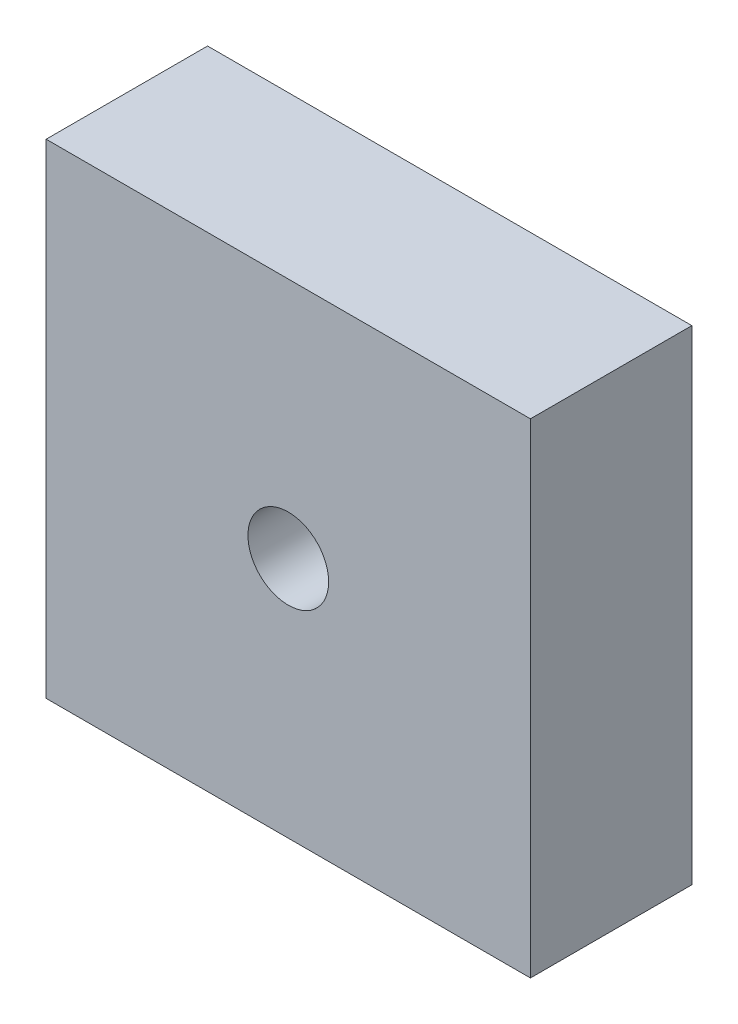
ISO-10303-21;
HEADER;
FILE_DESCRIPTION(('STEP AP214'),'2;1');
FILE_NAME('part.step','',(''),(''),'','','');
FILE_SCHEMA(('AUTOMOTIVE_DESIGN { 1 0 10303 214 1 1 1 1 }'));
ENDSEC;
DATA;
#1=APPLICATION_CONTEXT('core data for automotive mechanical design processes');
#2=APPLICATION_PROTOCOL_DEFINITION('international standard','automotive_design',2000,#1);
#3=PRODUCT_CONTEXT('',#1,'mechanical');
#4=PRODUCT('Part','Part','',(#3));
#5=PRODUCT_RELATED_PRODUCT_CATEGORY('part','',(#4));
#6=PRODUCT_DEFINITION_FORMATION('','',#4);
#7=PRODUCT_DEFINITION_CONTEXT('part definition',#1,'design');
#8=PRODUCT_DEFINITION('design','',#6,#7);
#9=PRODUCT_DEFINITION_SHAPE('','',#8);
#10=(LENGTH_UNIT() NAMED_UNIT(*) SI_UNIT(.MILLI.,.METRE.));
#11=(NAMED_UNIT(*) PLANE_ANGLE_UNIT() SI_UNIT($,.RADIAN.));
#12=(NAMED_UNIT(*) SI_UNIT($,.STERADIAN.) SOLID_ANGLE_UNIT());
#13=UNCERTAINTY_MEASURE_WITH_UNIT(LENGTH_MEASURE(1.E-05),#10,'distance_accuracy_value','');
#14=(GEOMETRIC_REPRESENTATION_CONTEXT(3) GLOBAL_UNCERTAINTY_ASSIGNED_CONTEXT((#13)) GLOBAL_UNIT_ASSIGNED_CONTEXT((#10,
#11,#12)) REPRESENTATION_CONTEXT('',''));
#15=CARTESIAN_POINT('',(0.,0.,0.));
#16=DIRECTION('',(0.,0.,1.));
#17=DIRECTION('',(1.,0.,0.));
#18=AXIS2_PLACEMENT_3D('',#15,#16,#17);
#19=CARTESIAN_POINT('',(0.,0.,5.));
#20=DIRECTION('',(0.,0.,-1.));
#21=DIRECTION('',(-1.,0.,0.));
#22=AXIS2_PLACEMENT_3D('',#19,#20,#21);
#23=PLANE('',#22);
#24=DIRECTION('',(0.,1.,0.));
#25=VECTOR('',#24,1.);
#26=CARTESIAN_POINT('',(15.,-15.,5.));
#27=LINE('',#26,#25);
#28=CARTESIAN_POINT('',(15.,-15.,5.));
#29=VERTEX_POINT('',#28);
#30=CARTESIAN_POINT('',(15.,15.,5.));
#31=VERTEX_POINT('',#30);
#32=EDGE_CURVE('E91',#29,#31,#27,.T.);
#33=ORIENTED_EDGE('',*,*,#32,.T.);
#34=DIRECTION('',(-1.,0.,0.));
#35=VECTOR('',#34,1.);
#36=CARTESIAN_POINT('',(-15.,15.,5.));
#37=LINE('',#36,#35);
#38=CARTESIAN_POINT('',(-15.,15.,5.));
#39=VERTEX_POINT('',#38);
#40=EDGE_CURVE('E86',#31,#39,#37,.T.);
#41=ORIENTED_EDGE('',*,*,#40,.T.);
#42=DIRECTION('',(0.,-1.,0.));
#43=VECTOR('',#42,1.);
#44=CARTESIAN_POINT('',(-15.,-15.,5.));
#45=LINE('',#44,#43);
#46=CARTESIAN_POINT('',(-15.,-15.,5.));
#47=VERTEX_POINT('',#46);
#48=EDGE_CURVE('E89',#39,#47,#45,.T.);
#49=ORIENTED_EDGE('',*,*,#48,.T.);
#50=DIRECTION('',(1.,0.,0.));
#51=VECTOR('',#50,1.);
#52=CARTESIAN_POINT('',(-15.,-15.,5.));
#53=LINE('',#52,#51);
#54=EDGE_CURVE('E56',#47,#29,#53,.T.);
#55=ORIENTED_EDGE('',*,*,#54,.T.);
#56=EDGE_LOOP('',(#33,#41,#49,#55));
#57=FACE_BOUND('',#56,.T.);
#58=CARTESIAN_POINT('',(0.,0.,5.));
#59=DIRECTION('',(0.,0.,1.));
#60=DIRECTION('',(1.,0.,0.));
#61=AXIS2_PLACEMENT_3D('',#58,#59,#60);
#62=CIRCLE('',#61,2.5);
#63=CARTESIAN_POINT('',(2.5,0.,5.));
#64=VERTEX_POINT('',#63);
#65=EDGE_CURVE('E106',#64,#64,#62,.T.);
#66=ORIENTED_EDGE('',*,*,#65,.F.);
#67=EDGE_LOOP('',(#66));
#68=FACE_BOUND('',#67,.T.);
#69=ADVANCED_FACE('F39',(#57,#68),#23,.F.);
#70=CARTESIAN_POINT('',(0.,0.,-5.));
#71=DIRECTION('',(0.,0.,-1.));
#72=DIRECTION('',(-1.,0.,0.));
#73=AXIS2_PLACEMENT_3D('',#70,#71,#72);
#74=PLANE('',#73);
#75=DIRECTION('',(0.,1.,0.));
#76=VECTOR('',#75,1.);
#77=CARTESIAN_POINT('',(15.,-15.,-5.));
#78=LINE('',#77,#76);
#79=CARTESIAN_POINT('',(15.,-15.,-5.));
#80=VERTEX_POINT('',#79);
#81=CARTESIAN_POINT('',(15.,15.,-5.));
#82=VERTEX_POINT('',#81);
#83=EDGE_CURVE('E103',#80,#82,#78,.T.);
#84=ORIENTED_EDGE('',*,*,#83,.F.);
#85=DIRECTION('',(1.,0.,0.));
#86=VECTOR('',#85,1.);
#87=CARTESIAN_POINT('',(-15.,-15.,-5.));
#88=LINE('',#87,#86);
#89=CARTESIAN_POINT('',(-15.,-15.,-5.));
#90=VERTEX_POINT('',#89);
#91=EDGE_CURVE('E79',#90,#80,#88,.T.);
#92=ORIENTED_EDGE('',*,*,#91,.F.);
#93=DIRECTION('',(0.,-1.,0.));
#94=VECTOR('',#93,1.);
#95=CARTESIAN_POINT('',(-15.,-15.,-5.));
#96=LINE('',#95,#94);
#97=CARTESIAN_POINT('',(-15.,15.,-5.));
#98=VERTEX_POINT('',#97);
#99=EDGE_CURVE('E73',#98,#90,#96,.T.);
#100=ORIENTED_EDGE('',*,*,#99,.F.);
#101=DIRECTION('',(-1.,0.,0.));
#102=VECTOR('',#101,1.);
#103=CARTESIAN_POINT('',(-15.,15.,-5.));
#104=LINE('',#103,#102);
#105=EDGE_CURVE('E95',#82,#98,#104,.T.);
#106=ORIENTED_EDGE('',*,*,#105,.F.);
#107=EDGE_LOOP('',(#84,#92,#100,#106));
#108=FACE_BOUND('',#107,.T.);
#109=CARTESIAN_POINT('',(0.,0.,-5.));
#110=DIRECTION('',(0.,0.,1.));
#111=DIRECTION('',(1.,0.,0.));
#112=AXIS2_PLACEMENT_3D('',#109,#110,#111);
#113=CIRCLE('',#112,2.5);
#114=CARTESIAN_POINT('',(2.5,0.,-5.));
#115=VERTEX_POINT('',#114);
#116=EDGE_CURVE('E118',#115,#115,#113,.T.);
#117=ORIENTED_EDGE('',*,*,#116,.T.);
#118=EDGE_LOOP('',(#117));
#119=FACE_BOUND('',#118,.T.);
#120=ADVANCED_FACE('F114',(#108,#119),#74,.T.);
#121=CARTESIAN_POINT('',(15.,-15.,5.));
#122=DIRECTION('',(-1.,0.,0.));
#123=DIRECTION('',(0.,0.,1.));
#124=AXIS2_PLACEMENT_3D('',#121,#122,#123);
#125=PLANE('',#124);
#126=ORIENTED_EDGE('',*,*,#83,.T.);
#127=DIRECTION('',(0.,0.,-1.));
#128=VECTOR('',#127,1.);
#129=CARTESIAN_POINT('',(15.,15.,5.));
#130=LINE('',#129,#128);
#131=EDGE_CURVE('E11',#31,#82,#130,.T.);
#132=ORIENTED_EDGE('',*,*,#131,.F.);
#133=ORIENTED_EDGE('',*,*,#32,.F.);
#134=DIRECTION('',(0.,0.,-1.));
#135=VECTOR('',#134,1.);
#136=CARTESIAN_POINT('',(15.,-15.,5.));
#137=LINE('',#136,#135);
#138=EDGE_CURVE('E99',#29,#80,#137,.T.);
#139=ORIENTED_EDGE('',*,*,#138,.T.);
#140=EDGE_LOOP('',(#126,#132,#133,#139));
#141=FACE_BOUND('',#140,.T.);
#142=ADVANCED_FACE('F41',(#141),#125,.F.);
#143=CARTESIAN_POINT('',(-15.,15.,5.));
#144=DIRECTION('',(0.,-1.,0.));
#145=DIRECTION('',(0.,0.,-1.));
#146=AXIS2_PLACEMENT_3D('',#143,#144,#145);
#147=PLANE('',#146);
#148=ORIENTED_EDGE('',*,*,#105,.T.);
#149=DIRECTION('',(0.,0.,-1.));
#150=VECTOR('',#149,1.);
#151=CARTESIAN_POINT('',(-15.,15.,5.));
#152=LINE('',#151,#150);
#153=EDGE_CURVE('E48',#39,#98,#152,.T.);
#154=ORIENTED_EDGE('',*,*,#153,.F.);
#155=ORIENTED_EDGE('',*,*,#40,.F.);
#156=ORIENTED_EDGE('',*,*,#131,.T.);
#157=EDGE_LOOP('',(#148,#154,#155,#156));
#158=FACE_BOUND('',#157,.T.);
#159=ADVANCED_FACE('F94',(#158),#147,.F.);
#160=CARTESIAN_POINT('',(-15.,-15.,5.));
#161=DIRECTION('',(1.,0.,0.));
#162=DIRECTION('',(0.,0.,-1.));
#163=AXIS2_PLACEMENT_3D('',#160,#161,#162);
#164=PLANE('',#163);
#165=ORIENTED_EDGE('',*,*,#99,.T.);
#166=DIRECTION('',(0.,0.,-1.));
#167=VECTOR('',#166,1.);
#168=CARTESIAN_POINT('',(-15.,-15.,5.));
#169=LINE('',#168,#167);
#170=EDGE_CURVE('E96',#47,#90,#169,.T.);
#171=ORIENTED_EDGE('',*,*,#170,.F.);
#172=ORIENTED_EDGE('',*,*,#48,.F.);
#173=ORIENTED_EDGE('',*,*,#153,.T.);
#174=EDGE_LOOP('',(#165,#171,#172,#173));
#175=FACE_BOUND('',#174,.T.);
#176=ADVANCED_FACE('F97',(#175),#164,.F.);
#177=CARTESIAN_POINT('',(-15.,-15.,5.));
#178=DIRECTION('',(0.,1.,0.));
#179=DIRECTION('',(0.,0.,1.));
#180=AXIS2_PLACEMENT_3D('',#177,#178,#179);
#181=PLANE('',#180);
#182=ORIENTED_EDGE('',*,*,#91,.T.);
#183=ORIENTED_EDGE('',*,*,#138,.F.);
#184=ORIENTED_EDGE('',*,*,#54,.F.);
#185=ORIENTED_EDGE('',*,*,#170,.T.);
#186=EDGE_LOOP('',(#182,#183,#184,#185));
#187=FACE_BOUND('',#186,.T.);
#188=ADVANCED_FACE('F111',(#187),#181,.F.);
#189=CARTESIAN_POINT('',(0.,0.,5.));
#190=DIRECTION('',(0.,0.,-1.));
#191=DIRECTION('',(-1.,0.,0.));
#192=AXIS2_PLACEMENT_3D('',#189,#190,#191);
#193=CYLINDRICAL_SURFACE('',#192,2.5);
#194=ORIENTED_EDGE('',*,*,#65,.T.);
#195=EDGE_LOOP('',(#194));
#196=FACE_BOUND('',#195,.T.);
#197=ORIENTED_EDGE('',*,*,#116,.F.);
#198=EDGE_LOOP('',(#197));
#199=FACE_BOUND('',#198,.T.);
#200=ADVANCED_FACE('F124',(#196,#199),#193,.F.);
#201=CLOSED_SHELL('',(#69,#120,#142,#159,#176,#188,#200));
#202=MANIFOLD_SOLID_BREP('B2',#201);
#203=ADVANCED_BREP_SHAPE_REPRESENTATION('',(#18,#202),#14);
#204=SHAPE_DEFINITION_REPRESENTATION(#9,#203);
ENDSEC;
END-ISO-10303-21;
